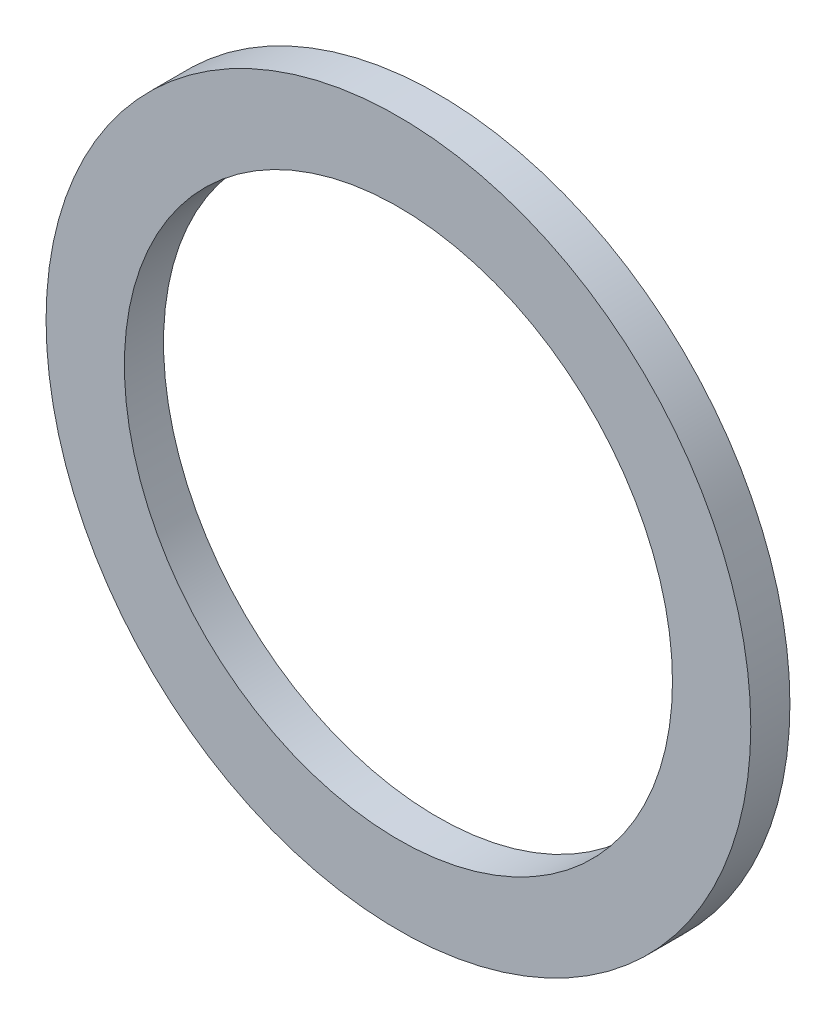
from build123d import *

# Parameters (mm, degrees)
SKETCH_1_R      = 18
SKETCH_1_R_2    = 14
EXTRUDE_1_DEPTH = 2


with BuildPart() as part:
    # Sketch 1 → Extrude 1 (new body)
    with BuildSketch(Plane.XY):
        Circle(SKETCH_1_R)
        Circle(SKETCH_1_R_2, mode=Mode.SUBTRACT)
    extrude(amount=EXTRUDE_1_DEPTH)


solid = part.part
